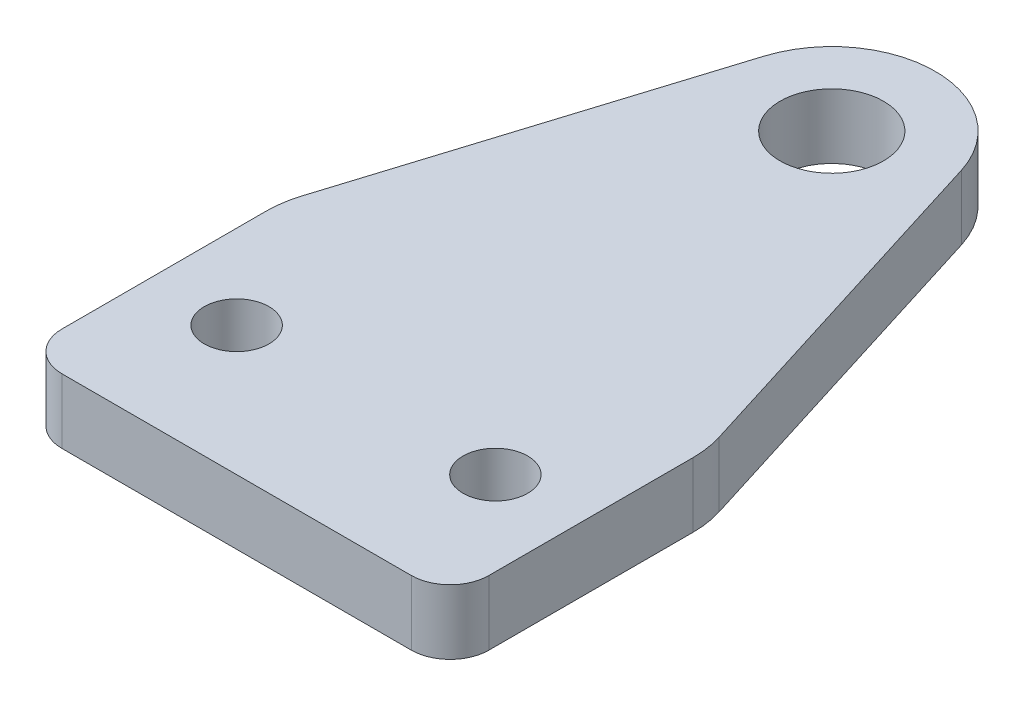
ISO-10303-21;
HEADER;
FILE_DESCRIPTION(('STEP AP214'),'2;1');
FILE_NAME('part.step','',(''),(''),'','','');
FILE_SCHEMA(('AUTOMOTIVE_DESIGN { 1 0 10303 214 1 1 1 1 }'));
ENDSEC;
DATA;
#1=APPLICATION_CONTEXT('core data for automotive mechanical design processes');
#2=APPLICATION_PROTOCOL_DEFINITION('international standard','automotive_design',2000,#1);
#3=PRODUCT_CONTEXT('',#1,'mechanical');
#4=PRODUCT('Part','Part','',(#3));
#5=PRODUCT_RELATED_PRODUCT_CATEGORY('part','',(#4));
#6=PRODUCT_DEFINITION_FORMATION('','',#4);
#7=PRODUCT_DEFINITION_CONTEXT('part definition',#1,'design');
#8=PRODUCT_DEFINITION('design','',#6,#7);
#9=PRODUCT_DEFINITION_SHAPE('','',#8);
#10=(LENGTH_UNIT() NAMED_UNIT(*) SI_UNIT(.MILLI.,.METRE.));
#11=(NAMED_UNIT(*) PLANE_ANGLE_UNIT() SI_UNIT($,.RADIAN.));
#12=(NAMED_UNIT(*) SI_UNIT($,.STERADIAN.) SOLID_ANGLE_UNIT());
#13=UNCERTAINTY_MEASURE_WITH_UNIT(LENGTH_MEASURE(1.E-05),#10,'distance_accuracy_value','');
#14=(GEOMETRIC_REPRESENTATION_CONTEXT(3) GLOBAL_UNCERTAINTY_ASSIGNED_CONTEXT((#13)) GLOBAL_UNIT_ASSIGNED_CONTEXT((#10,
#11,#12)) REPRESENTATION_CONTEXT('',''));
#15=CARTESIAN_POINT('',(0.,0.,0.));
#16=DIRECTION('',(0.,0.,1.));
#17=DIRECTION('',(1.,0.,0.));
#18=AXIS2_PLACEMENT_3D('',#15,#16,#17);
#19=CARTESIAN_POINT('',(8.5,0.,-8.77997015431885));
#20=DIRECTION('',(0.,-1.,0.));
#21=DIRECTION('',(0.,0.,-1.));
#22=AXIS2_PLACEMENT_3D('',#19,#20,#21);
#23=PLANE('',#22);
#24=CARTESIAN_POINT('',(10.,0.,0.));
#25=DIRECTION('',(0.,-1.,0.));
#26=DIRECTION('',(0.,0.,-1.));
#27=AXIS2_PLACEMENT_3D('',#24,#25,#26);
#28=CIRCLE('',#27,2.5);
#29=CARTESIAN_POINT('',(10.,0.,-2.5));
#30=VERTEX_POINT('',#29);
#31=EDGE_CURVE('E155',#30,#30,#28,.F.);
#32=ORIENTED_EDGE('',*,*,#31,.T.);
#33=EDGE_LOOP('',(#32));
#34=FACE_BOUND('',#33,.T.);
#35=CARTESIAN_POINT('',(0.,0.,-36.));
#36=DIRECTION('',(0.,-1.,0.));
#37=DIRECTION('',(0.,0.,-1.));
#38=AXIS2_PLACEMENT_3D('',#35,#36,#37);
#39=CIRCLE('',#38,4.);
#40=CARTESIAN_POINT('',(0.,0.,-40.));
#41=VERTEX_POINT('',#40);
#42=EDGE_CURVE('E118',#41,#41,#39,.F.);
#43=ORIENTED_EDGE('',*,*,#42,.T.);
#44=EDGE_LOOP('',(#43));
#45=FACE_BOUND('',#44,.T.);
#46=CARTESIAN_POINT('',(-10.,0.,0.));
#47=DIRECTION('',(0.,-1.,0.));
#48=DIRECTION('',(0.,0.,-1.));
#49=AXIS2_PLACEMENT_3D('',#46,#47,#48);
#50=CIRCLE('',#49,2.5);
#51=CARTESIAN_POINT('',(-10.,0.,-2.5));
#52=VERTEX_POINT('',#51);
#53=EDGE_CURVE('E158',#52,#52,#50,.F.);
#54=ORIENTED_EDGE('',*,*,#53,.T.);
#55=EDGE_LOOP('',(#54));
#56=FACE_BOUND('',#55,.T.);
#57=DIRECTION('',(0.298075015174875,0.,0.954542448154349));
#58=VECTOR('',#57,1.);
#59=CARTESIAN_POINT('',(7.63633958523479,0.,-38.384600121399));
#60=LINE('',#59,#58);
#61=CARTESIAN_POINT('',(7.63633958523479,0.,-38.384600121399));
#62=VERTEX_POINT('',#61);
#63=CARTESIAN_POINT('',(16.1363395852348,0.,-11.1645702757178));
#64=VERTEX_POINT('',#63);
#65=EDGE_CURVE('E124',#62,#64,#60,.T.);
#66=ORIENTED_EDGE('',*,*,#65,.T.);
#67=CARTESIAN_POINT('',(8.5,0.,-8.77997015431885));
#68=DIRECTION('',(0.,-1.,0.));
#69=DIRECTION('',(0.,0.,-1.));
#70=AXIS2_PLACEMENT_3D('',#67,#68,#69);
#71=CIRCLE('',#70,8.);
#72=CARTESIAN_POINT('',(16.5,0.,-8.77997015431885));
#73=VERTEX_POINT('',#72);
#74=EDGE_CURVE('E126',#73,#64,#71,.F.);
#75=ORIENTED_EDGE('',*,*,#74,.F.);
#76=DIRECTION('',(0.,0.,1.));
#77=VECTOR('',#76,1.);
#78=CARTESIAN_POINT('',(16.5,0.,-8.77997015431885));
#79=LINE('',#78,#77);
#80=CARTESIAN_POINT('',(16.5,0.,7.));
#81=VERTEX_POINT('',#80);
#82=EDGE_CURVE('E119',#73,#81,#79,.T.);
#83=ORIENTED_EDGE('',*,*,#82,.T.);
#84=CARTESIAN_POINT('',(13.5,0.,7.));
#85=DIRECTION('',(0.,-1.,0.));
#86=DIRECTION('',(0.,0.,-1.));
#87=AXIS2_PLACEMENT_3D('',#84,#85,#86);
#88=CIRCLE('',#87,3.);
#89=CARTESIAN_POINT('',(13.5,0.,10.));
#90=VERTEX_POINT('',#89);
#91=EDGE_CURVE('E122',#90,#81,#88,.F.);
#92=ORIENTED_EDGE('',*,*,#91,.F.);
#93=DIRECTION('',(-1.,0.,0.));
#94=VECTOR('',#93,1.);
#95=CARTESIAN_POINT('',(16.5,0.,10.));
#96=LINE('',#95,#94);
#97=CARTESIAN_POINT('',(-13.5,0.,10.));
#98=VERTEX_POINT('',#97);
#99=EDGE_CURVE('E97',#90,#98,#96,.T.);
#100=ORIENTED_EDGE('',*,*,#99,.T.);
#101=CARTESIAN_POINT('',(-13.5,0.,7.));
#102=DIRECTION('',(0.,-1.,0.));
#103=DIRECTION('',(0.,0.,-1.));
#104=AXIS2_PLACEMENT_3D('',#101,#102,#103);
#105=CIRCLE('',#104,3.);
#106=CARTESIAN_POINT('',(-16.5,0.,7.));
#107=VERTEX_POINT('',#106);
#108=EDGE_CURVE('E20',#107,#98,#105,.F.);
#109=ORIENTED_EDGE('',*,*,#108,.F.);
#110=DIRECTION('',(0.,0.,1.));
#111=VECTOR('',#110,1.);
#112=CARTESIAN_POINT('',(-16.5,0.,-8.77997015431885));
#113=LINE('',#112,#111);
#114=CARTESIAN_POINT('',(-16.5,0.,-8.77997015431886));
#115=VERTEX_POINT('',#114);
#116=EDGE_CURVE('E95',#107,#115,#113,.F.);
#117=ORIENTED_EDGE('',*,*,#116,.T.);
#118=CARTESIAN_POINT('',(-8.5,0.,-8.77997015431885));
#119=DIRECTION('',(0.,-1.,0.));
#120=DIRECTION('',(0.,0.,-1.));
#121=AXIS2_PLACEMENT_3D('',#118,#119,#120);
#122=CIRCLE('',#121,8.);
#123=CARTESIAN_POINT('',(-16.1363395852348,0.,-11.1645702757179));
#124=VERTEX_POINT('',#123);
#125=EDGE_CURVE('E108',#124,#115,#122,.F.);
#126=ORIENTED_EDGE('',*,*,#125,.F.);
#127=DIRECTION('',(0.298075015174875,0.,-0.954542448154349));
#128=VECTOR('',#127,1.);
#129=CARTESIAN_POINT('',(-16.1363395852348,0.,-11.1645702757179));
#130=LINE('',#129,#128);
#131=CARTESIAN_POINT('',(-7.63633958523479,0.,-38.384600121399));
#132=VERTEX_POINT('',#131);
#133=EDGE_CURVE('E128',#124,#132,#130,.T.);
#134=ORIENTED_EDGE('',*,*,#133,.T.);
#135=CARTESIAN_POINT('',(0.,0.,-36.));
#136=DIRECTION('',(0.,-1.,0.));
#137=DIRECTION('',(0.,0.,-1.));
#138=AXIS2_PLACEMENT_3D('',#135,#136,#137);
#139=CIRCLE('',#138,8.);
#140=EDGE_CURVE('E167',#62,#132,#139,.F.);
#141=ORIENTED_EDGE('',*,*,#140,.F.);
#142=EDGE_LOOP('',(#66,#75,#83,#92,#100,#109,#117,#126,#134,#141));
#143=FACE_BOUND('',#142,.T.);
#144=ADVANCED_FACE('F17',(#34,#45,#56,#143),#23,.T.);
#145=CARTESIAN_POINT('',(-13.5,5.,7.));
#146=DIRECTION('',(0.,-1.,0.));
#147=DIRECTION('',(0.,0.,-1.));
#148=AXIS2_PLACEMENT_3D('',#145,#146,#147);
#149=CYLINDRICAL_SURFACE('',#148,3.);
#150=ORIENTED_EDGE('',*,*,#108,.T.);
#151=DIRECTION('',(0.,1.,0.));
#152=VECTOR('',#151,1.);
#153=CARTESIAN_POINT('',(-13.5,5.,10.));
#154=LINE('',#153,#152);
#155=CARTESIAN_POINT('',(-13.5,5.,10.));
#156=VERTEX_POINT('',#155);
#157=EDGE_CURVE('E179',#98,#156,#154,.T.);
#158=ORIENTED_EDGE('',*,*,#157,.T.);
#159=CARTESIAN_POINT('',(-13.5,5.,7.));
#160=DIRECTION('',(0.,-1.,0.));
#161=DIRECTION('',(0.,0.,-1.));
#162=AXIS2_PLACEMENT_3D('',#159,#160,#161);
#163=CIRCLE('',#162,3.);
#164=CARTESIAN_POINT('',(-16.5,5.,7.));
#165=VERTEX_POINT('',#164);
#166=EDGE_CURVE('E112',#156,#165,#163,.T.);
#167=ORIENTED_EDGE('',*,*,#166,.T.);
#168=DIRECTION('',(0.,1.,0.));
#169=VECTOR('',#168,1.);
#170=CARTESIAN_POINT('',(-16.5,5.,7.));
#171=LINE('',#170,#169);
#172=EDGE_CURVE('E102',#165,#107,#171,.F.);
#173=ORIENTED_EDGE('',*,*,#172,.T.);
#174=EDGE_LOOP('',(#150,#158,#167,#173));
#175=FACE_BOUND('',#174,.T.);
#176=ADVANCED_FACE('F111',(#175),#149,.T.);
#177=CARTESIAN_POINT('',(-16.5,5.,-8.77997015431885));
#178=DIRECTION('',(1.,0.,0.));
#179=DIRECTION('',(0.,1.,0.));
#180=AXIS2_PLACEMENT_3D('',#177,#178,#179);
#181=PLANE('',#180);
#182=ORIENTED_EDGE('',*,*,#172,.F.);
#183=DIRECTION('',(0.,0.,-1.));
#184=VECTOR('',#183,1.);
#185=CARTESIAN_POINT('',(-16.5,5.,-8.77997015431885));
#186=LINE('',#185,#184);
#187=CARTESIAN_POINT('',(-16.5,5.,-8.77997015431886));
#188=VERTEX_POINT('',#187);
#189=EDGE_CURVE('E153',#165,#188,#186,.T.);
#190=ORIENTED_EDGE('',*,*,#189,.T.);
#191=DIRECTION('',(0.,-1.,0.));
#192=VECTOR('',#191,1.);
#193=CARTESIAN_POINT('',(-16.5,5.,-8.77997015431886));
#194=LINE('',#193,#192);
#195=EDGE_CURVE('E107',#115,#188,#194,.F.);
#196=ORIENTED_EDGE('',*,*,#195,.F.);
#197=ORIENTED_EDGE('',*,*,#116,.F.);
#198=EDGE_LOOP('',(#182,#190,#196,#197));
#199=FACE_BOUND('',#198,.T.);
#200=ADVANCED_FACE('F104',(#199),#181,.F.);
#201=CARTESIAN_POINT('',(-8.5,5.,-8.77997015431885));
#202=DIRECTION('',(0.,-1.,0.));
#203=DIRECTION('',(0.,0.,-1.));
#204=AXIS2_PLACEMENT_3D('',#201,#202,#203);
#205=CYLINDRICAL_SURFACE('',#204,8.);
#206=CARTESIAN_POINT('',(-8.5,5.,-8.77997015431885));
#207=DIRECTION('',(0.,-1.,0.));
#208=DIRECTION('',(0.,0.,-1.));
#209=AXIS2_PLACEMENT_3D('',#206,#207,#208);
#210=CIRCLE('',#209,8.);
#211=CARTESIAN_POINT('',(-16.1363395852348,5.,-11.1645702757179));
#212=VERTEX_POINT('',#211);
#213=EDGE_CURVE('E150',#188,#212,#210,.T.);
#214=ORIENTED_EDGE('',*,*,#213,.T.);
#215=DIRECTION('',(0.,1.,0.));
#216=VECTOR('',#215,1.);
#217=CARTESIAN_POINT('',(-16.1363395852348,5.,-11.1645702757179));
#218=LINE('',#217,#216);
#219=EDGE_CURVE('E131',#212,#124,#218,.F.);
#220=ORIENTED_EDGE('',*,*,#219,.T.);
#221=ORIENTED_EDGE('',*,*,#125,.T.);
#222=ORIENTED_EDGE('',*,*,#195,.T.);
#223=EDGE_LOOP('',(#214,#220,#221,#222));
#224=FACE_BOUND('',#223,.T.);
#225=ADVANCED_FACE('F225',(#224),#205,.T.);
#226=CARTESIAN_POINT('',(-16.1363395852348,5.,-11.1645702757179));
#227=DIRECTION('',(0.954542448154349,0.,0.298075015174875));
#228=DIRECTION('',(0.298075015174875,0.,-0.954542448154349));
#229=AXIS2_PLACEMENT_3D('',#226,#227,#228);
#230=PLANE('',#229);
#231=ORIENTED_EDGE('',*,*,#219,.F.);
#232=DIRECTION('',(0.298075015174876,0.,-0.954542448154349));
#233=VECTOR('',#232,1.);
#234=CARTESIAN_POINT('',(-16.1363395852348,5.,-11.1645702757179));
#235=LINE('',#234,#233);
#236=CARTESIAN_POINT('',(-7.63633958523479,5.,-38.384600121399));
#237=VERTEX_POINT('',#236);
#238=EDGE_CURVE('E149',#212,#237,#235,.T.);
#239=ORIENTED_EDGE('',*,*,#238,.T.);
#240=DIRECTION('',(0.,-1.,0.));
#241=VECTOR('',#240,1.);
#242=CARTESIAN_POINT('',(-7.6363395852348,5.,-38.384600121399));
#243=LINE('',#242,#241);
#244=EDGE_CURVE('E130',#132,#237,#243,.F.);
#245=ORIENTED_EDGE('',*,*,#244,.F.);
#246=ORIENTED_EDGE('',*,*,#133,.F.);
#247=EDGE_LOOP('',(#231,#239,#245,#246));
#248=FACE_BOUND('',#247,.T.);
#249=ADVANCED_FACE('F214',(#248),#230,.F.);
#250=CARTESIAN_POINT('',(0.,5.,-36.));
#251=DIRECTION('',(0.,-1.,0.));
#252=DIRECTION('',(0.,0.,-1.));
#253=AXIS2_PLACEMENT_3D('',#250,#251,#252);
#254=CYLINDRICAL_SURFACE('',#253,8.);
#255=DIRECTION('',(0.,1.,0.));
#256=VECTOR('',#255,1.);
#257=CARTESIAN_POINT('',(7.63633958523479,5.,-38.384600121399));
#258=LINE('',#257,#256);
#259=CARTESIAN_POINT('',(7.63633958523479,5.,-38.384600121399));
#260=VERTEX_POINT('',#259);
#261=EDGE_CURVE('E127',#260,#62,#258,.F.);
#262=ORIENTED_EDGE('',*,*,#261,.T.);
#263=ORIENTED_EDGE('',*,*,#140,.T.);
#264=ORIENTED_EDGE('',*,*,#244,.T.);
#265=CARTESIAN_POINT('',(0.,5.,-36.));
#266=DIRECTION('',(0.,-1.,0.));
#267=DIRECTION('',(0.,0.,-1.));
#268=AXIS2_PLACEMENT_3D('',#265,#266,#267);
#269=CIRCLE('',#268,8.);
#270=EDGE_CURVE('E147',#237,#260,#269,.T.);
#271=ORIENTED_EDGE('',*,*,#270,.T.);
#272=EDGE_LOOP('',(#262,#263,#264,#271));
#273=FACE_BOUND('',#272,.T.);
#274=ADVANCED_FACE('F216',(#273),#254,.T.);
#275=CARTESIAN_POINT('',(7.63633958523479,5.,-38.384600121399));
#276=DIRECTION('',(-0.954542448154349,0.,0.298075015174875));
#277=DIRECTION('',(0.298075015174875,0.,0.954542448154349));
#278=AXIS2_PLACEMENT_3D('',#275,#276,#277);
#279=PLANE('',#278);
#280=ORIENTED_EDGE('',*,*,#261,.F.);
#281=DIRECTION('',(0.298075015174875,0.,0.954542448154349));
#282=VECTOR('',#281,1.);
#283=CARTESIAN_POINT('',(7.63633958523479,5.,-38.384600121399));
#284=LINE('',#283,#282);
#285=CARTESIAN_POINT('',(16.1363395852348,5.,-11.1645702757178));
#286=VERTEX_POINT('',#285);
#287=EDGE_CURVE('E146',#260,#286,#284,.T.);
#288=ORIENTED_EDGE('',*,*,#287,.T.);
#289=DIRECTION('',(0.,-1.,0.));
#290=VECTOR('',#289,1.);
#291=CARTESIAN_POINT('',(16.1363395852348,5.,-11.1645702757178));
#292=LINE('',#291,#290);
#293=EDGE_CURVE('E166',#64,#286,#292,.F.);
#294=ORIENTED_EDGE('',*,*,#293,.F.);
#295=ORIENTED_EDGE('',*,*,#65,.F.);
#296=EDGE_LOOP('',(#280,#288,#294,#295));
#297=FACE_BOUND('',#296,.T.);
#298=ADVANCED_FACE('F208',(#297),#279,.F.);
#299=CARTESIAN_POINT('',(8.5,5.,-8.77997015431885));
#300=DIRECTION('',(0.,-1.,0.));
#301=DIRECTION('',(0.,0.,-1.));
#302=AXIS2_PLACEMENT_3D('',#299,#300,#301);
#303=CYLINDRICAL_SURFACE('',#302,8.);
#304=CARTESIAN_POINT('',(8.5,5.,-8.77997015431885));
#305=DIRECTION('',(0.,-1.,0.));
#306=DIRECTION('',(0.,0.,-1.));
#307=AXIS2_PLACEMENT_3D('',#304,#305,#306);
#308=CIRCLE('',#307,8.);
#309=CARTESIAN_POINT('',(16.5,5.,-8.77997015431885));
#310=VERTEX_POINT('',#309);
#311=EDGE_CURVE('E143',#286,#310,#308,.T.);
#312=ORIENTED_EDGE('',*,*,#311,.T.);
#313=DIRECTION('',(0.,1.,0.));
#314=VECTOR('',#313,1.);
#315=CARTESIAN_POINT('',(16.5,5.,-8.77997015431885));
#316=LINE('',#315,#314);
#317=EDGE_CURVE('E123',#310,#73,#316,.F.);
#318=ORIENTED_EDGE('',*,*,#317,.T.);
#319=ORIENTED_EDGE('',*,*,#74,.T.);
#320=ORIENTED_EDGE('',*,*,#293,.T.);
#321=EDGE_LOOP('',(#312,#318,#319,#320));
#322=FACE_BOUND('',#321,.T.);
#323=ADVANCED_FACE('F203',(#322),#303,.T.);
#324=CARTESIAN_POINT('',(16.5,5.,-8.77997015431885));
#325=DIRECTION('',(-1.,0.,0.));
#326=DIRECTION('',(0.,0.,1.));
#327=AXIS2_PLACEMENT_3D('',#324,#325,#326);
#328=PLANE('',#327);
#329=DIRECTION('',(0.,-1.,0.));
#330=VECTOR('',#329,1.);
#331=CARTESIAN_POINT('',(16.5,5.,7.));
#332=LINE('',#331,#330);
#333=CARTESIAN_POINT('',(16.5,5.,7.));
#334=VERTEX_POINT('',#333);
#335=EDGE_CURVE('E164',#81,#334,#332,.F.);
#336=ORIENTED_EDGE('',*,*,#335,.F.);
#337=ORIENTED_EDGE('',*,*,#82,.F.);
#338=ORIENTED_EDGE('',*,*,#317,.F.);
#339=DIRECTION('',(0.,0.,-1.));
#340=VECTOR('',#339,1.);
#341=CARTESIAN_POINT('',(16.5,5.,-8.77997015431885));
#342=LINE('',#341,#340);
#343=EDGE_CURVE('E142',#310,#334,#342,.F.);
#344=ORIENTED_EDGE('',*,*,#343,.T.);
#345=EDGE_LOOP('',(#336,#337,#338,#344));
#346=FACE_BOUND('',#345,.T.);
#347=ADVANCED_FACE('F199',(#346),#328,.F.);
#348=CARTESIAN_POINT('',(13.5,5.,7.));
#349=DIRECTION('',(0.,-1.,0.));
#350=DIRECTION('',(0.,0.,-1.));
#351=AXIS2_PLACEMENT_3D('',#348,#349,#350);
#352=CYLINDRICAL_SURFACE('',#351,3.);
#353=ORIENTED_EDGE('',*,*,#91,.T.);
#354=ORIENTED_EDGE('',*,*,#335,.T.);
#355=CARTESIAN_POINT('',(13.5,5.,7.));
#356=DIRECTION('',(0.,-1.,0.));
#357=DIRECTION('',(0.,0.,-1.));
#358=AXIS2_PLACEMENT_3D('',#355,#356,#357);
#359=CIRCLE('',#358,3.);
#360=CARTESIAN_POINT('',(13.5,5.,10.));
#361=VERTEX_POINT('',#360);
#362=EDGE_CURVE('E139',#334,#361,#359,.T.);
#363=ORIENTED_EDGE('',*,*,#362,.T.);
#364=DIRECTION('',(0.,1.,0.));
#365=VECTOR('',#364,1.);
#366=CARTESIAN_POINT('',(13.5,5.,10.));
#367=LINE('',#366,#365);
#368=EDGE_CURVE('E35',#361,#90,#367,.F.);
#369=ORIENTED_EDGE('',*,*,#368,.T.);
#370=EDGE_LOOP('',(#353,#354,#363,#369));
#371=FACE_BOUND('',#370,.T.);
#372=ADVANCED_FACE('F195',(#371),#352,.T.);
#373=CARTESIAN_POINT('',(16.5,5.,10.));
#374=DIRECTION('',(0.,0.,-1.));
#375=DIRECTION('',(-1.,0.,0.));
#376=AXIS2_PLACEMENT_3D('',#373,#374,#375);
#377=PLANE('',#376);
#378=ORIENTED_EDGE('',*,*,#368,.F.);
#379=DIRECTION('',(1.,0.,0.));
#380=VECTOR('',#379,1.);
#381=CARTESIAN_POINT('',(8.5,5.,10.));
#382=LINE('',#381,#380);
#383=EDGE_CURVE('E138',#361,#156,#382,.F.);
#384=ORIENTED_EDGE('',*,*,#383,.T.);
#385=ORIENTED_EDGE('',*,*,#157,.F.);
#386=ORIENTED_EDGE('',*,*,#99,.F.);
#387=EDGE_LOOP('',(#378,#384,#385,#386));
#388=FACE_BOUND('',#387,.T.);
#389=ADVANCED_FACE('F189',(#388),#377,.F.);
#390=CARTESIAN_POINT('',(0.,5.,-36.));
#391=DIRECTION('',(0.,-1.,0.));
#392=DIRECTION('',(0.,0.,-1.));
#393=AXIS2_PLACEMENT_3D('',#390,#391,#392);
#394=CYLINDRICAL_SURFACE('',#393,4.);
#395=ORIENTED_EDGE('',*,*,#42,.F.);
#396=EDGE_LOOP('',(#395));
#397=FACE_BOUND('',#396,.T.);
#398=CARTESIAN_POINT('',(0.,5.,-36.));
#399=DIRECTION('',(0.,-1.,0.));
#400=DIRECTION('',(0.,0.,-1.));
#401=AXIS2_PLACEMENT_3D('',#398,#399,#400);
#402=CIRCLE('',#401,4.);
#403=CARTESIAN_POINT('',(0.,5.,-40.));
#404=VERTEX_POINT('',#403);
#405=EDGE_CURVE('E135',#404,#404,#402,.F.);
#406=ORIENTED_EDGE('',*,*,#405,.T.);
#407=EDGE_LOOP('',(#406));
#408=FACE_BOUND('',#407,.T.);
#409=ADVANCED_FACE('F242',(#397,#408),#394,.F.);
#410=CARTESIAN_POINT('',(-10.,5.,0.));
#411=DIRECTION('',(0.,-1.,0.));
#412=DIRECTION('',(0.,0.,-1.));
#413=AXIS2_PLACEMENT_3D('',#410,#411,#412);
#414=CYLINDRICAL_SURFACE('',#413,2.5);
#415=ORIENTED_EDGE('',*,*,#53,.F.);
#416=EDGE_LOOP('',(#415));
#417=FACE_BOUND('',#416,.T.);
#418=CARTESIAN_POINT('',(-10.,5.,0.));
#419=DIRECTION('',(0.,-1.,0.));
#420=DIRECTION('',(0.,0.,-1.));
#421=AXIS2_PLACEMENT_3D('',#418,#419,#420);
#422=CIRCLE('',#421,2.5);
#423=CARTESIAN_POINT('',(-10.,5.,-2.5));
#424=VERTEX_POINT('',#423);
#425=EDGE_CURVE('E26',#424,#424,#422,.F.);
#426=ORIENTED_EDGE('',*,*,#425,.T.);
#427=EDGE_LOOP('',(#426));
#428=FACE_BOUND('',#427,.T.);
#429=ADVANCED_FACE('F234',(#417,#428),#414,.F.);
#430=CARTESIAN_POINT('',(10.,5.,0.));
#431=DIRECTION('',(0.,-1.,0.));
#432=DIRECTION('',(0.,0.,-1.));
#433=AXIS2_PLACEMENT_3D('',#430,#431,#432);
#434=CYLINDRICAL_SURFACE('',#433,2.5);
#435=ORIENTED_EDGE('',*,*,#31,.F.);
#436=EDGE_LOOP('',(#435));
#437=FACE_BOUND('',#436,.T.);
#438=CARTESIAN_POINT('',(10.,5.,0.));
#439=DIRECTION('',(0.,-1.,0.));
#440=DIRECTION('',(0.,0.,-1.));
#441=AXIS2_PLACEMENT_3D('',#438,#439,#440);
#442=CIRCLE('',#441,2.5);
#443=CARTESIAN_POINT('',(10.,5.,-2.5));
#444=VERTEX_POINT('',#443);
#445=EDGE_CURVE('E11',#444,#444,#442,.F.);
#446=ORIENTED_EDGE('',*,*,#445,.T.);
#447=EDGE_LOOP('',(#446));
#448=FACE_BOUND('',#447,.T.);
#449=ADVANCED_FACE('F228',(#437,#448),#434,.F.);
#450=CARTESIAN_POINT('',(8.5,5.,-8.77997015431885));
#451=DIRECTION('',(0.,-1.,0.));
#452=DIRECTION('',(0.,0.,-1.));
#453=AXIS2_PLACEMENT_3D('',#450,#451,#452);
#454=PLANE('',#453);
#455=ORIENTED_EDGE('',*,*,#445,.F.);
#456=EDGE_LOOP('',(#455));
#457=FACE_BOUND('',#456,.T.);
#458=ORIENTED_EDGE('',*,*,#425,.F.);
#459=EDGE_LOOP('',(#458));
#460=FACE_BOUND('',#459,.T.);
#461=ORIENTED_EDGE('',*,*,#405,.F.);
#462=EDGE_LOOP('',(#461));
#463=FACE_BOUND('',#462,.T.);
#464=ORIENTED_EDGE('',*,*,#362,.F.);
#465=ORIENTED_EDGE('',*,*,#343,.F.);
#466=ORIENTED_EDGE('',*,*,#311,.F.);
#467=ORIENTED_EDGE('',*,*,#287,.F.);
#468=ORIENTED_EDGE('',*,*,#270,.F.);
#469=ORIENTED_EDGE('',*,*,#238,.F.);
#470=ORIENTED_EDGE('',*,*,#213,.F.);
#471=ORIENTED_EDGE('',*,*,#189,.F.);
#472=ORIENTED_EDGE('',*,*,#166,.F.);
#473=ORIENTED_EDGE('',*,*,#383,.F.);
#474=EDGE_LOOP('',(#464,#465,#466,#467,#468,#469,#470,#471,#472,#473));
#475=FACE_BOUND('',#474,.T.);
#476=ADVANCED_FACE('F192',(#457,#460,#463,#475),#454,.F.);
#477=CLOSED_SHELL('',(#144,#176,#200,#225,#249,#274,#298,#323,#347,#372,#389,#409,#429,#449,#476));
#478=MANIFOLD_SOLID_BREP('B1',#477);
#479=ADVANCED_BREP_SHAPE_REPRESENTATION('',(#18,#478),#14);
#480=SHAPE_DEFINITION_REPRESENTATION(#9,#479);
ENDSEC;
END-ISO-10303-21;
